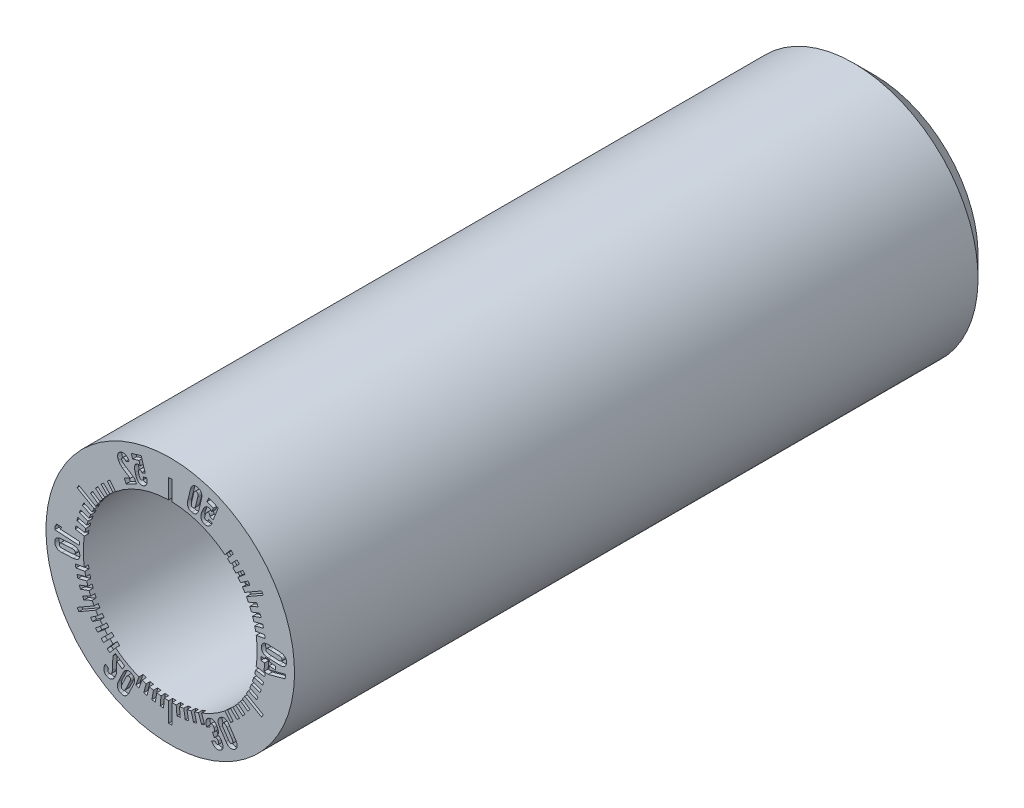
from build123d import *

# Parameters (mm, degrees)
SKETCH2_W          = 0.08
SKETCH2_H          = 0.48
CUT_EXTRUDE1_DEPTH = 0.1


with BuildPart() as part:
    # Sketch1 → Revolve1 (revolve)
    with BuildSketch(Plane(origin=(0, 0, 0), x_dir=(0, 0, -1), z_dir=(1, 0, 0))):
        Polygon((17, 1.5), (17, 2.5), (16.5, 3), (0, 3), (0, 2.1), (3, 2.1), (3, 0.8), (12, 0.8), (12, 1.5), align=None)
    revolve(axis=Axis((0, 0, 0), (0, 0, 1)))

    # Sketch2 → Cut-Extrude1 (cut)
    # profile 1 of 58: a face of its own
    with BuildSketch(Plane.XY):
        Polygon((2.205685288, 1.319641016), (2.245685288, 1.250358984), (1.829993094, 1.010358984), (1.789993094, 1.079641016), align=None)
    # profile 2 of 58: a face of its own
    with BuildSketch(Plane.XY):
        with Locations((0, 2.33)):
            Rectangle(SKETCH2_W, SKETCH2_H)
    # profile 3 of 58: a face of its own
    with BuildSketch(Plane.XY):
        Polygon((-0.22200329, -2.078560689), (-0.142307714, -2.085533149), (-0.162353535, -2.314657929), (-0.242049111, -2.30768547), align=None)
    # profile 4 of 58: a face of its own
    with BuildSketch(Plane.XY):
        Polygon((2.245685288, -1.250358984), (2.205685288, -1.319641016), (1.789993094, -1.079641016), (1.829993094, -1.010358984), align=None)
    # profile 5 of 58: a face of its own
    with BuildSketch(Plane.XY):
        with Locations((0, -2.33)):
            Rectangle(SKETCH2_W, SKETCH2_H)
    # profile 6 of 58: a face of its own
    with BuildSketch(Plane.XY):
        Polygon((-0.402317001, -2.051302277), (-0.323532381, -2.065194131), (-0.363471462, -2.291699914), (-0.442256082, -2.27780806), align=None)
    # profile 7 of 58: a face of its own
    with BuildSketch(Plane.XY):
        Polygon((-2.205685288, -1.319641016), (-2.245685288, -1.250358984), (-1.829993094, -1.010358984), (-1.789993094, -1.079641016), align=None)
    # profile 8 of 58: a face of its own
    with BuildSketch(Plane.XY):
        Polygon((-0.579568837, -2.008432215), (-0.502294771, -2.029137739), (-0.561823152, -2.251300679), (-0.639097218, -2.230595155), align=None)
    # profile 9 of 58: a face of its own
    with BuildSketch(Plane.XY):
        Polygon((-2.245685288, 1.250358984), (-2.205685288, 1.319641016), (-1.789993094, 1.079641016), (-1.829993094, 1.010358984), align=None)
    # profile 10 of 58: a face of its own
    with BuildSketch(Plane.XY):
        Polygon((-0.752409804, -1.950276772), (-0.677234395, -1.977638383), (-0.755899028, -2.193767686), (-0.831074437, -2.166406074), align=None)
    # profile 11 of 58: a face of its own
    with BuildSketch(Plane.XY):
        with BuildLine():
            Line((1.012567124, 2.139475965), (0.931509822, 2.17278633))
            add(Edge.make_bspline(
                [(0.931509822, 2.17278633), (0.927149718, 2.163558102), (0.919493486, 2.15175248), (0.90750455, 2.138416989), (0.898176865, 2.131412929), (0.888604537, 2.126540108), (0.875337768, 2.123610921), (0.865232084, 2.125155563), (0.859103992, 2.127751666)],
                knots=[0, 0, 0, 0, 0.312990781, 0.447470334, 0.570627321, 0.683640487, 0.788056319, 1, 1, 1, 1], degree=3))
            add(Edge.make_bspline(
                [(0.859103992, 2.127751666), (0.852602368, 2.130364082), (0.843675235, 2.136467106), (0.836164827, 2.148482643), (0.83289104, 2.159032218), (0.831745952, 2.170979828), (0.833511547, 2.18971781), (0.83798066, 2.203916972), (0.841915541, 2.21352782)],
                knots=[0, 0, 0, 0, 0.214623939, 0.317977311, 0.427535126, 0.549200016, 0.682311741, 1, 1, 1, 1], degree=3))
            Line((0.841915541, 2.21352782), (0.86048477, 2.2593165))
            add(Edge.make_bspline(
                [(0.86048477, 2.2593165), (0.864442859, 2.268847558), (0.870699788, 2.282292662), (0.882118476, 2.29696064), (0.890653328, 2.304951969), (0.899717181, 2.310325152), (0.912178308, 2.314408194), (0.922056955, 2.312834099), (0.92786212, 2.310392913)],
                knots=[0, 0, 0, 0, 0.329173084, 0.466161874, 0.588661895, 0.698350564, 0.798670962, 1, 1, 1, 1], degree=3))
            add(Edge.make_bspline(
                [(0.92786212, 2.310392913), (0.933485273, 2.308293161), (0.941027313, 2.303439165), (0.949014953, 2.294677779), (0.95341906, 2.286940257), (0.956523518, 2.278329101), (0.959018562, 2.26542631), (0.9581625, 2.255261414), (0.957253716, 2.24845063)],
                knots=[0, 0, 0, 0, 0.24024523, 0.355022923, 0.473972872, 0.595859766, 0.722023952, 1, 1, 1, 1], degree=3))
            Line((0.957253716, 2.24845063), (1.03316966, 2.217608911))
            Line((1.03316966, 2.217608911), (1.160623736, 2.531541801))
            Line((1.160623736, 2.531541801), (0.929024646, 2.625620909))
            Line((0.929024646, 2.625620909), (0.888775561, 2.526511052))
            Line((0.888775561, 2.526511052), (1.039152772, 2.465399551))
            Line((1.039152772, 2.465399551), (0.999966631, 2.368942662))
            add(Edge.make_bspline(
                [(0.999966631, 2.368942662), (0.998267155, 2.373980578), (0.994855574, 2.381498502), (0.988170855, 2.390454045), (0.982213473, 2.397029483), (0.975631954, 2.403157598), (0.966118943, 2.410031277), (0.958539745, 2.414302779), (0.953205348, 2.416406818)],
                knots=[0, 0, 0, 0, 0.232906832, 0.35742045, 0.487452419, 0.620741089, 0.749919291, 1, 1, 1, 1], degree=3))
            add(Edge.make_bspline(
                [(0.953205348, 2.416406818), (0.942679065, 2.420509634), (0.926144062, 2.42489065), (0.903797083, 2.424009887), (0.887622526, 2.42042038), (0.871837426, 2.414070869), (0.856603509, 2.404661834), (0.841923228, 2.392480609), (0.827751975, 2.377617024), (0.814392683, 2.359974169), (0.796692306, 2.332095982), (0.785937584, 2.308707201), (0.779176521, 2.292367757)],
                knots=[0, 0, 0, 0, 0.14203951, 0.210199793, 0.278275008, 0.348605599, 0.422260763, 0.501581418, 0.586912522, 0.678871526, 0.778295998, 1, 1, 1, 1], degree=3))
            Line((0.779176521, 2.292367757), (0.760607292, 2.246579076))
            add(Edge.make_bspline(
                [(0.760607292, 2.246579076), (0.754153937, 2.230108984), (0.745640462, 2.20566197), (0.740046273, 2.172860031), (0.738495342, 2.150339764), (0.73965291, 2.129194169), (0.743246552, 2.109445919), (0.749800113, 2.091337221), (0.758605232, 2.074682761), (0.770295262, 2.059901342), (0.789592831, 2.042189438), (0.807240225, 2.032442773), (0.819810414, 2.027381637)],
                knots=[0, 0, 0, 0, 0.207219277, 0.30093946, 0.388368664, 0.47061663, 0.547977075, 0.622169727, 0.694941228, 0.767314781, 0.841383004, 1, 1, 1, 1], degree=3))
            add(Edge.make_bspline(
                [(0.819810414, 2.027381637), (0.83092788, 2.022851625), (0.84853877, 2.018346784), (0.87252145, 2.018368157), (0.890398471, 2.020947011), (0.908099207, 2.026342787), (0.925285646, 2.03482944), (0.942016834, 2.045895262), (0.958135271, 2.059673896), (0.973416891, 2.076071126), (0.993085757, 2.101978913), (1.005355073, 2.12391518), (1.012567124, 2.139475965)],
                knots=[0, 0, 0, 0, 0.145628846, 0.217084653, 0.28946727, 0.363822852, 0.440348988, 0.520959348, 0.606364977, 0.696725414, 0.792102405, 1, 1, 1, 1], degree=3))
        make_face()
    # profile 12 of 58: a face of its own
    with BuildSketch(Plane.XY):
        with BuildLine():
            Line((0.691740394, 2.254600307), (0.755107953, 2.51545086))
            add(Edge.make_bspline(
                [(0.755107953, 2.51545086), (0.75820861, 2.527610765), (0.761445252, 2.545701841), (0.763339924, 2.569450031), (0.763607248, 2.585968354), (0.762097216, 2.601661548), (0.75963341, 2.616587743), (0.755576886, 2.630677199), (0.750238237, 2.643908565), (0.743577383, 2.656197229), (0.735606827, 2.66746444), (0.726264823, 2.677565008), (0.715694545, 2.68663215), (0.703712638, 2.694331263), (0.685783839, 2.703706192), (0.67087089, 2.708278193), (0.660648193, 2.71094947)],
                knots=[0, 0, 0, 0, 0.15255475, 0.222884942, 0.289580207, 0.353124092, 0.414337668, 0.473292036, 0.531016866, 0.587519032, 0.642883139, 0.698386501, 0.754422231, 0.811742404, 0.871200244, 1, 1, 1, 1], degree=3))
            add(Edge.make_bspline(
                [(0.660648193, 2.71094947), (0.650317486, 2.713475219), (0.634859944, 2.715896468), (0.614526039, 2.716149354), (0.600314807, 2.714575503), (0.586769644, 2.711608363), (0.573892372, 2.706842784), (0.561702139, 2.700542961), (0.550175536, 2.692734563), (0.539395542, 2.683454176), (0.529449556, 2.672746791), (0.520202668, 2.66076646), (0.512012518, 2.647272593), (0.504329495, 2.632597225), (0.495307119, 2.610421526), (0.489746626, 2.592872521), (0.486914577, 2.580587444)],
                knots=[0, 0, 0, 0, 0.129149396, 0.189243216, 0.246495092, 0.302472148, 0.357261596, 0.412781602, 0.46877136, 0.52599839, 0.585182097, 0.646014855, 0.709492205, 0.776677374, 0.847026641, 1, 1, 1, 1], degree=3))
            Line((0.486914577, 2.580587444), (0.423547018, 2.319736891))
            add(Edge.make_bspline(
                [(0.423547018, 2.319736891), (0.420446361, 2.307576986), (0.417209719, 2.28948591), (0.415315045, 2.265737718), (0.415047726, 2.249219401), (0.416557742, 2.233526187), (0.419021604, 2.218600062), (0.423077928, 2.204510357), (0.4284173, 2.191279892), (0.435075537, 2.17898797), (0.443055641, 2.16773264), (0.452329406, 2.157623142), (0.463025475, 2.148720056), (0.474875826, 2.14083757), (0.492891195, 2.13151044), (0.507773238, 2.12689395), (0.518006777, 2.124238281)],
                knots=[0, 0, 0, 0, 0.152562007, 0.222895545, 0.289593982, 0.35314089, 0.414357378, 0.47331455, 0.531042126, 0.587546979, 0.642913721, 0.698419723, 0.753874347, 0.811733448, 0.871194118, 1, 1, 1, 1], degree=3))
            add(Edge.make_bspline(
                [(0.518006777, 2.124238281), (0.52833715, 2.121743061), (0.543760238, 2.119240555), (0.564112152, 2.119113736), (0.578318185, 2.120677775), (0.591903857, 2.123806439), (0.604859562, 2.128478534), (0.617013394, 2.135076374), (0.628635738, 2.142942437), (0.639431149, 2.152367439), (0.64931345, 2.163217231), (0.658543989, 2.175190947), (0.666882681, 2.188550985), (0.674482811, 2.203186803), (0.683430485, 2.225125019), (0.688830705, 2.242511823), (0.691740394, 2.254600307)],
                knots=[0, 0, 0, 0, 0.129287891, 0.189012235, 0.247001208, 0.30266616, 0.35820295, 0.413902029, 0.470380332, 0.528573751, 0.587690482, 0.648588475, 0.712173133, 0.778942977, 0.848882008, 1, 1, 1, 1], degree=3))
        make_face()
        with BuildLine():
            Line((0.514851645, 2.32691207), (0.564759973, 2.532452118))
            add(Edge.make_bspline(
                [(0.564759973, 2.532452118), (0.568055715, 2.54467106), (0.572857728, 2.562186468), (0.583557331, 2.582107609), (0.59163611, 2.593524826), (0.600985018, 2.601982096), (0.615382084, 2.609094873), (0.627722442, 2.608746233), (0.635325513, 2.606813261)],
                knots=[0, 0, 0, 0, 0.331526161, 0.46844105, 0.588018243, 0.694560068, 0.793837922, 1, 1, 1, 1], degree=3))
            add(Edge.make_bspline(
                [(0.635325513, 2.606813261), (0.643027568, 2.605098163), (0.654117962, 2.599658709), (0.663746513, 2.58676388), (0.668214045, 2.574939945), (0.670359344, 2.561079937), (0.670292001, 2.538436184), (0.66687395, 2.52067471), (0.663965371, 2.508327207)],
                knots=[0, 0, 0, 0, 0.206443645, 0.305849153, 0.412344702, 0.53233251, 0.669077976, 1, 1, 1, 1], degree=3))
            Line((0.663965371, 2.508327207), (0.614057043, 2.30278716))
            add(Edge.make_bspline(
                [(0.614057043, 2.30278716), (0.611121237, 2.290420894), (0.60576221, 2.273164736), (0.595419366, 2.252984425), (0.587114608, 2.241685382), (0.577820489, 2.233081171), (0.563218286, 2.226381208), (0.551012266, 2.226253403), (0.543329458, 2.228374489)],
                knots=[0, 0, 0, 0, 0.331056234, 0.467727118, 0.588299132, 0.694660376, 0.793572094, 1, 1, 1, 1], degree=3))
            add(Edge.make_bspline(
                [(0.543329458, 2.228374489), (0.535644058, 2.230105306), (0.524540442, 2.235483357), (0.515011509, 2.248378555), (0.510644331, 2.260202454), (0.508581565, 2.274075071), (0.508657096, 2.29675511), (0.5118223, 2.314566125), (0.514851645, 2.32691207)],
                knots=[0, 0, 0, 0, 0.206549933, 0.305065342, 0.410830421, 0.531716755, 0.668532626, 1, 1, 1, 1], degree=3))
        make_face(mode=Mode.SUBTRACT)
    # profile 13 of 58: a face of its own
    with BuildSketch(Plane.XY):
        Polygon((-1.374067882, -1.575321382), (-1.312784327, -1.626744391), (-1.460625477, -1.802934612), (-1.521909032, -1.751511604), align=None)
    # profile 14 of 58: a face of its own
    with BuildSketch(Plane.XY):
        Polygon((-1.506137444, -1.449568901), (-1.449568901, -1.506137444), (-1.612203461, -1.668772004), (-1.668772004, -1.612203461), align=None)
    # profile 15 of 58: a face of its own
    with BuildSketch(Plane.XY):
        Polygon((-1.626744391, -1.312784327), (-1.575321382, -1.374067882), (-1.751511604, -1.521909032), (-1.802934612, -1.460625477), align=None)
    # profile 16 of 58: a face of its own
    with BuildSketch(Plane.XY):
        Polygon((-1.73497083, -1.16600867), (-1.689084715, -1.231540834), (-1.877489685, -1.363463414), (-1.9233758, -1.297931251), align=None)
    # profile 17 of 58: a face of its own
    with BuildSketch(Plane.XY):
        Polygon((-1.911088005, -0.847019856), (-1.877278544, -0.919524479), (-2.085729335, -1.016726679), (-2.119538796, -0.944222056), align=None)
    # profile 18 of 58: a face of its own
    with BuildSketch(Plane.XY):
        Polygon((-1.977638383, -0.677234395), (-1.950276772, -0.752409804), (-2.166406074, -0.831074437), (-2.193767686, -0.755899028), align=None)
    # profile 19 of 58: a face of its own
    with BuildSketch(Plane.XY):
        Polygon((-2.029137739, -0.502294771), (-2.008432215, -0.579568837), (-2.230595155, -0.639097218), (-2.251300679, -0.561823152), align=None)
    # profile 20 of 58: a face of its own
    with BuildSketch(Plane.XY):
        Polygon((-2.065194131, -0.323532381), (-2.051302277, -0.402317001), (-2.27780806, -0.442256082), (-2.291699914, -0.363471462), align=None)
    # profile 21 of 58: a face of its own
    with BuildSketch(Plane.XY):
        with BuildLine():
            Line((-0.569282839, 2.297528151), (-0.65286232, 2.272143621))
            add(Edge.make_bspline(
                [(-0.65286232, 2.272143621), (-0.650661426, 2.262225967), (-0.648527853, 2.248263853), (-0.649647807, 2.23040026), (-0.652307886, 2.219120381), (-0.656670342, 2.209351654), (-0.664925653, 2.198633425), (-0.673740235, 2.193435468), (-0.680106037, 2.191620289)],
                knots=[0, 0, 0, 0, 0.313997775, 0.448349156, 0.571080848, 0.683382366, 0.788550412, 1, 1, 1, 1], degree=3))
            add(Edge.make_bspline(
                [(-0.680106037, 2.191620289), (-0.686764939, 2.189496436), (-0.697550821, 2.188469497), (-0.710900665, 2.19317526), (-0.720118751, 2.199194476), (-0.72848707, 2.207807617), (-0.739140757, 2.223250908), (-0.744368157, 2.237219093), (-0.747550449, 2.24703004)],
                knots=[0, 0, 0, 0, 0.215045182, 0.317610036, 0.42812181, 0.549157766, 0.682889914, 1, 1, 1, 1], degree=3))
            Line((-0.747550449, 2.24703004), (-0.76210757, 2.29431748))
            add(Edge.make_bspline(
                [(-0.76210757, 2.29431748), (-0.76509783, 2.304175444), (-0.768632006, 2.318525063), (-0.76914942, 2.337057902), (-0.767531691, 2.348604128), (-0.764016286, 2.35845331), (-0.756961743, 2.369429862), (-0.748366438, 2.374393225), (-0.742384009, 2.376254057)],
                knots=[0, 0, 0, 0, 0.329547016, 0.467152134, 0.589297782, 0.699293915, 0.798546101, 1, 1, 1, 1], degree=3))
            add(Edge.make_bspline(
                [(-0.742384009, 2.376254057), (-0.736752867, 2.378045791), (-0.727872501, 2.379322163), (-0.716299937, 2.377292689), (-0.707969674, 2.374390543), (-0.700149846, 2.369708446), (-0.690099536, 2.361238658), (-0.684105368, 2.352968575), (-0.680579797, 2.346991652)],
                knots=[0, 0, 0, 0, 0.239083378, 0.353493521, 0.471595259, 0.593169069, 0.719161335, 1, 1, 1, 1], degree=3))
            Line((-0.680579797, 2.346991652), (-0.602688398, 2.371109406))
            Line((-0.602688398, 2.371109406), (-0.702601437, 2.694740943))
            Line((-0.702601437, 2.694740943), (-0.940365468, 2.621339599))
            Line((-0.940365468, 2.621339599), (-0.908794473, 2.519122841))
            Line((-0.908794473, 2.519122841), (-0.754505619, 2.566774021))
            Line((-0.754505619, 2.566774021), (-0.723800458, 2.467315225))
            add(Edge.make_bspline(
                [(-0.723800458, 2.467315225), (-0.728149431, 2.470492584), (-0.735712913, 2.473616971), (-0.746391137, 2.476834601), (-0.755160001, 2.477904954), (-0.764107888, 2.478315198), (-0.77576005, 2.477831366), (-0.784271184, 2.476099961), (-0.789682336, 2.474419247)],
                knots=[0, 0, 0, 0, 0.234107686, 0.357852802, 0.488706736, 0.620739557, 0.751178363, 1, 1, 1, 1], degree=3))
            add(Edge.make_bspline(
                [(-0.789682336, 2.474419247), (-0.800409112, 2.470998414), (-0.815902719, 2.463956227), (-0.83263703, 2.449280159), (-0.842891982, 2.436306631), (-0.850917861, 2.421357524), (-0.856906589, 2.40451612), (-0.860305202, 2.385772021), (-0.86178438, 2.365283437), (-0.860976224, 2.343169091), (-0.857003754, 2.310375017), (-0.850458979, 2.285496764), (-0.845415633, 2.268535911)],
                knots=[0, 0, 0, 0, 0.141697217, 0.209535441, 0.277427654, 0.348020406, 0.421419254, 0.50068579, 0.586179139, 0.67863213, 0.777784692, 1, 1, 1, 1], degree=3))
            Line((-0.845415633, 2.268535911), (-0.830858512, 2.22124847))
            add(Edge.make_bspline(
                [(-0.830858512, 2.22124847), (-0.825783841, 2.20424575), (-0.816318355, 2.180261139), (-0.800361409, 2.151128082), (-0.787265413, 2.132865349), (-0.773201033, 2.117142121), (-0.757845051, 2.10434032), (-0.741459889, 2.094320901), (-0.724092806, 2.087041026), (-0.705734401, 2.082977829), (-0.679650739, 2.081262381), (-0.659869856, 2.085050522), (-0.646963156, 2.089021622)],
                knots=[0, 0, 0, 0, 0.207804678, 0.301190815, 0.388577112, 0.470615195, 0.547780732, 0.621990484, 0.694946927, 0.767401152, 0.841348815, 1, 1, 1, 1], degree=3))
            add(Edge.make_bspline(
                [(-0.646963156, 2.089021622), (-0.635496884, 2.092484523), (-0.619308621, 2.100324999), (-0.600623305, 2.115170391), (-0.588658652, 2.128584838), (-0.578409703, 2.143900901), (-0.570434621, 2.161260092), (-0.564541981, 2.180390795), (-0.56088456, 2.201245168), (-0.559400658, 2.223587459), (-0.560694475, 2.256111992), (-0.565042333, 2.280882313), (-0.569282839, 2.297528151)],
                knots=[0, 0, 0, 0, 0.145227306, 0.216025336, 0.288647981, 0.362692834, 0.439093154, 0.519843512, 0.605223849, 0.695708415, 0.791338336, 1, 1, 1, 1], degree=3))
        make_face()
    # profile 22 of 58: a face of its own
    with BuildSketch(Plane.XY):
        with BuildLine():
            Line((-0.856824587, 2.132263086), (-1.115203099, 2.305923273))
            add(Edge.make_bspline(
                [(-1.115203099, 2.305923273), (-1.126428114, 2.313425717), (-1.146013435, 2.330008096), (-1.161174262, 2.35076476), (-1.166380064, 2.361613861)],
                knots=[0, 0, 0, 0, 0.529594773, 1, 1, 1, 1], degree=3))
            add(Edge.make_bspline(
                [(-1.166380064, 2.361613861), (-1.169642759, 2.368845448), (-1.173216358, 2.378712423), (-1.173644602, 2.392110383), (-1.171805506, 2.401022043), (-1.16816535, 2.409243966), (-1.160193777, 2.419225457), (-1.151924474, 2.424749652), (-1.14576871, 2.427502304)],
                knots=[0, 0, 0, 0, 0.27628058, 0.396763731, 0.512177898, 0.624234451, 0.740143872, 1, 1, 1, 1], degree=3))
            add(Edge.make_bspline(
                [(-1.14576871, 2.427502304), (-1.139708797, 2.430655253), (-1.129487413, 2.432584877), (-1.115812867, 2.430587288), (-1.10578248, 2.426248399), (-1.095988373, 2.419694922), (-1.0828143, 2.407009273), (-1.074521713, 2.395218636), (-1.069614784, 2.386445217)],
                knots=[0, 0, 0, 0, 0.211891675, 0.317260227, 0.428941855, 0.551462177, 0.684934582, 1, 1, 1, 1], degree=3))
            Line((-1.069614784, 2.386445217), (-0.988137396, 2.424487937))
            add(Edge.make_bspline(
                [(-0.988137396, 2.424487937), (-0.996502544, 2.440089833), (-1.00995192, 2.461512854), (-1.03100048, 2.486562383), (-1.047172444, 2.502118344), (-1.064045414, 2.515051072), (-1.081509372, 2.525046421), (-1.099347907, 2.532429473), (-1.117634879, 2.536858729), (-1.136173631, 2.538338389), (-1.161272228, 2.536336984), (-1.179504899, 2.530503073), (-1.19109566, 2.525101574)],
                knots=[0, 0, 0, 0, 0.206179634, 0.29971853, 0.388669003, 0.472666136, 0.552006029, 0.627422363, 0.701644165, 0.774934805, 0.8477835, 1, 1, 1, 1], degree=3))
            add(Edge.make_bspline(
                [(-1.19109566, 2.525101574), (-1.203290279, 2.519207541), (-1.220657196, 2.509218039), (-1.239561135, 2.491486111), (-1.250962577, 2.477321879), (-1.259975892, 2.46189584), (-1.266204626, 2.445229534), (-1.270098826, 2.427551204), (-1.271025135, 2.408869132), (-1.26978444, 2.389311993), (-1.264133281, 2.361229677), (-1.256413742, 2.340421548), (-1.249784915, 2.326715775)],
                knots=[0, 0, 0, 0, 0.173465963, 0.252943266, 0.329718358, 0.404937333, 0.480032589, 0.55602585, 0.635156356, 0.718067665, 0.805679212, 1, 1, 1, 1], degree=3))
            add(Edge.make_bspline(
                [(-1.249784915, 2.326715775), (-1.24378032, 2.314277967), (-1.233985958, 2.296588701), (-1.218497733, 2.274437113), (-1.205620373, 2.258688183), (-1.192079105, 2.243706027), (-1.173136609, 2.225633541), (-1.157708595, 2.213792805), (-1.146949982, 2.206839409)],
                knots=[0, 0, 0, 0, 0.252707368, 0.379472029, 0.507964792, 0.635168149, 0.759146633, 1, 1, 1, 1], degree=3))
            Line((-1.146949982, 2.206839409), (-0.964890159, 2.089168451))
            Line((-0.964890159, 2.089168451), (-1.108742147, 2.021339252))
            Line((-1.108742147, 2.021339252), (-1.062847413, 1.924051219))
            Line((-1.062847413, 1.924051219), (-0.813938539, 2.041346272))
            Line((-0.813938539, 2.041346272), (-0.856824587, 2.132263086))
        make_face()
    # profile 23 of 58: a face of its own
    with BuildSketch(Plane.XY):
        Polygon((-2.051302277, 0.402317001), (-2.065194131, 0.323532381), (-2.291699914, 0.363471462), (-2.27780806, 0.442256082), align=None)
    # profile 24 of 58: a face of its own
    with BuildSketch(Plane.XY):
        Polygon((-2.008432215, 0.579568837), (-2.029137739, 0.502294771), (-2.251300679, 0.561823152), (-2.230595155, 0.639097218), align=None)
    # profile 25 of 58: a face of its own
    with BuildSketch(Plane.XY):
        Polygon((-1.950276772, 0.752409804), (-1.977638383, 0.677234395), (-2.193767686, 0.755899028), (-2.166406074, 0.831074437), align=None)
    # profile 26 of 58: a face of its own
    with BuildSketch(Plane.XY):
        Polygon((-1.877278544, 0.919524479), (-1.911088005, 0.847019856), (-2.119538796, 0.944222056), (-2.085729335, 1.016726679), align=None)
    # profile 27 of 58: a face of its own
    with BuildSketch(Plane.XY):
        Polygon((-1.689084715, 1.231540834), (-1.73497083, 1.16600867), (-1.9233758, 1.297931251), (-1.877489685, 1.363463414), align=None)
    # profile 28 of 58: a face of its own
    with BuildSketch(Plane.XY):
        Polygon((-1.575321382, 1.374067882), (-1.626744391, 1.312784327), (-1.802934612, 1.460625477), (-1.751511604, 1.521909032), align=None)
    # profile 29 of 58: a face of its own
    with BuildSketch(Plane.XY):
        Polygon((-1.449568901, 1.506137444), (-1.506137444, 1.449568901), (-1.668772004, 1.612203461), (-1.612203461, 1.668772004), align=None)
    # profile 30 of 58: a face of its own
    with BuildSketch(Plane.XY):
        Polygon((-1.312784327, 1.626744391), (-1.374067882, 1.575321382), (-1.521909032, 1.751511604), (-1.460625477, 1.802934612), align=None)
    # profile 31 of 58: a face of its own
    with BuildSketch(Plane.XY):
        Polygon((-2.197118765, 0.068190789), (-2.192026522, 0.155720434), (-2.651430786, 0.182500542), (-2.620837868, 0.237409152), (-2.739030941, 0.244250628), (-2.782763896, 0.177312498), (-2.787100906, 0.102525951), align=None)
    # profile 32 of 58: a face of its own
    with BuildSketch(Plane.XY):
        with BuildLine():
            Line((-2.358344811, 0.005855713), (-2.626580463, -0.009382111))
            add(Edge.make_bspline(
                [(-2.626580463, -0.009382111), (-2.639136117, -0.010203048), (-2.657440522, -0.012083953), (-2.680768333, -0.017192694), (-2.696615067, -0.022002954), (-2.711336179, -0.027830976), (-2.724798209, -0.034889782), (-2.737186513, -0.042772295), (-2.748274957, -0.051810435), (-2.758181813, -0.061752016), (-2.766449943, -0.072857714), (-2.773639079, -0.08469988), (-2.778999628, -0.09764446), (-2.783080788, -0.111400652), (-2.786533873, -0.131523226), (-2.787048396, -0.147217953), (-2.786313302, -0.157905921)],
                knots=[0, 0, 0, 0, 0.152361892, 0.222101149, 0.288692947, 0.35258765, 0.41338833, 0.472388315, 0.529973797, 0.586180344, 0.641757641, 0.69714838, 0.753398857, 0.810781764, 0.870479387, 1, 1, 1, 1], degree=3))
            add(Edge.make_bspline(
                [(-2.786313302, -0.157905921), (-2.785781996, -0.168621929), (-2.783506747, -0.184188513), (-2.777958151, -0.203914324), (-2.772263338, -0.217116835), (-2.765449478, -0.229360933), (-2.757153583, -0.240392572), (-2.747551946, -0.250333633), (-2.736750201, -0.259181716), (-2.724644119, -0.26675095), (-2.711530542, -0.27331625), (-2.697293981, -0.278524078), (-2.682092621, -0.282864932), (-2.665757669, -0.285577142), (-2.641943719, -0.288129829), (-2.623462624, -0.287819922), (-2.610858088, -0.287243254)],
                knots=[0, 0, 0, 0, 0.129655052, 0.189679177, 0.247360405, 0.303196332, 0.358829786, 0.413817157, 0.470049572, 0.527297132, 0.586204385, 0.647138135, 0.710435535, 0.777173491, 0.847173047, 1, 1, 1, 1], degree=3))
            Line((-2.610858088, -0.287243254), (-2.342622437, -0.272005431))
            add(Edge.make_bspline(
                [(-2.342622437, -0.272005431), (-2.330105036, -0.27119814), (-2.311805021, -0.269292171), (-2.288473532, -0.264206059), (-2.272619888, -0.259407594), (-2.257955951, -0.253542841), (-2.24452185, -0.246514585), (-2.232141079, -0.238624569), (-2.221029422, -0.229603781), (-2.211206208, -0.219602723), (-2.202629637, -0.20871196), (-2.195779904, -0.196692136), (-2.190290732, -0.183837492), (-2.186082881, -0.170127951), (-2.182676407, -0.149979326), (-2.182129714, -0.134291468), (-2.182876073, -0.123601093)],
                knots=[0, 0, 0, 0, 0.151970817, 0.222235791, 0.288868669, 0.352335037, 0.413173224, 0.472209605, 0.529830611, 0.58607183, 0.641670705, 0.697193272, 0.753056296, 0.810665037, 0.870399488, 1, 1, 1, 1], degree=3))
            add(Edge.make_bspline(
                [(-2.182876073, -0.123601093), (-2.183473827, -0.112906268), (-2.185561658, -0.097272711), (-2.191401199, -0.077632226), (-2.197011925, -0.064308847), (-2.204098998, -0.05217632), (-2.21244566, -0.041049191), (-2.222216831, -0.0311558), (-2.233211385, -0.022302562), (-2.245313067, -0.014593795), (-2.258580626, -0.008235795), (-2.272694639, -0.002747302), (-2.287962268, 0.001261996), (-2.304136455, 0.00434039), (-2.327731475, 0.006437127), (-2.345922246, 0.006807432), (-2.358344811, 0.005855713)],
                knots=[0, 0, 0, 0, 0.129785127, 0.189953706, 0.247692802, 0.304415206, 0.359686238, 0.415706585, 0.472335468, 0.530322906, 0.589027, 0.650243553, 0.713423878, 0.779903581, 0.849396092, 1, 1, 1, 1], degree=3))
        make_face()
        with BuildLine():
            Line((-2.376060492, -0.186126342), (-2.587433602, -0.198073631))
            add(Edge.make_bspline(
                [(-2.587433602, -0.198073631), (-2.600127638, -0.198585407), (-2.61831385, -0.198973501), (-2.64057439, -0.194604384), (-2.653860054, -0.190060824), (-2.664613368, -0.183493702), (-2.675556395, -0.17168349), (-2.678824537, -0.159749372), (-2.679186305, -0.151829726)],
                knots=[0, 0, 0, 0, 0.331488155, 0.468204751, 0.587932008, 0.694653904, 0.792379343, 1, 1, 1, 1], degree=3))
            add(Edge.make_bspline(
                [(-2.679186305, -0.151829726), (-2.679532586, -0.143974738), (-2.67795175, -0.13157426), (-2.668260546, -0.118669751), (-2.658393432, -0.110750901), (-2.645628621, -0.104874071), (-2.624053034, -0.09788262), (-2.605937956, -0.096149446), (-2.593261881, -0.095274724)],
                knots=[0, 0, 0, 0, 0.207404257, 0.306093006, 0.412310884, 0.532766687, 0.668670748, 1, 1, 1, 1], degree=3))
            Line((-2.593261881, -0.095274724), (-2.381888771, -0.083327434))
            add(Edge.make_bspline(
                [(-2.381888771, -0.083327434), (-2.369163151, -0.082603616), (-2.351041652, -0.082717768), (-2.328730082, -0.086759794), (-2.31546105, -0.091346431), (-2.304669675, -0.0979447), (-2.293650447, -0.109765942), (-2.290319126, -0.121743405), (-2.290003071, -0.129677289)],
                knots=[0, 0, 0, 0, 0.331220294, 0.467434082, 0.586995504, 0.693569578, 0.792612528, 1, 1, 1, 1], degree=3))
            add(Edge.make_bspline(
                [(-2.290003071, -0.129677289), (-2.289554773, -0.137554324), (-2.291385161, -0.149791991), (-2.300852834, -0.16288851), (-2.310969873, -0.170584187), (-2.323677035, -0.176546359), (-2.345283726, -0.183501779), (-2.363375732, -0.18526168), (-2.376060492, -0.186126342)],
                knots=[0, 0, 0, 0, 0.20642854, 0.305872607, 0.412399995, 0.532837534, 0.668720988, 1, 1, 1, 1], degree=3))
        make_face(mode=Mode.SUBTRACT)
    # profile 33 of 58: a face of its own
    with BuildSketch(Plane.XY):
        with BuildLine():
            Line((-1.383614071, -1.834607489), (-1.397987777, -2.145306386))
            add(Edge.make_bspline(
                [(-1.397987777, -2.145306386), (-1.398455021, -2.158795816), (-1.402629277, -2.184026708), (-1.412232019, -2.207787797), (-1.418906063, -2.217778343)],
                knots=[0, 0, 0, 0, 0.530063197, 1, 1, 1, 1], degree=3))
            add(Edge.make_bspline(
                [(-1.418906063, -2.217778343), (-1.423262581, -2.224334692), (-1.430061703, -2.232276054), (-1.441177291, -2.239752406), (-1.449775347, -2.242756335), (-1.458670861, -2.243874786), (-1.47137353, -2.242179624), (-1.480365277, -2.237865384), (-1.48597864, -2.234089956)],
                knots=[0, 0, 0, 0, 0.276237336, 0.397001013, 0.511354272, 0.623690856, 0.739101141, 1, 1, 1, 1], degree=3))
            add(Edge.make_bspline(
                [(-1.48597864, -2.234089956), (-1.491736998, -2.230449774), (-1.498794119, -2.222810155), (-1.504146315, -2.210066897), (-1.505735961, -2.199284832), (-1.50519645, -2.187466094), (-1.501181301, -2.169608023), (-1.495311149, -2.156402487), (-1.490465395, -2.147608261)],
                knots=[0, 0, 0, 0, 0.212205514, 0.316427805, 0.428810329, 0.550715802, 0.68516851, 1, 1, 1, 1], degree=3))
            Line((-1.490465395, -2.147608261), (-1.565265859, -2.097429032))
            add(Edge.make_bspline(
                [(-1.565265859, -2.097429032), (-1.574127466, -2.112763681), (-1.58585259, -2.135255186), (-1.595988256, -2.166378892), (-1.60110256, -2.188233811), (-1.603271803, -2.209318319), (-1.603021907, -2.229426), (-1.599947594, -2.248520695), (-1.594128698, -2.266425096), (-1.585967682, -2.283138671), (-1.570989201, -2.303451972), (-1.556792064, -2.31632893), (-1.545916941, -2.32326565)],
                knots=[0, 0, 0, 0, 0.205825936, 0.299741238, 0.388594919, 0.472186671, 0.551118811, 0.627055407, 0.701176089, 0.774239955, 0.847174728, 1, 1, 1, 1], degree=3))
            add(Edge.make_bspline(
                [(-1.545916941, -2.32326565), (-1.534590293, -2.330813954), (-1.51687667, -2.340125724), (-1.491964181, -2.347399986), (-1.47390242, -2.349850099), (-1.456070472, -2.349472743), (-1.438568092, -2.346458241), (-1.421586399, -2.340384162), (-1.404942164, -2.331909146), (-1.388990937, -2.320486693), (-1.367776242, -2.301353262), (-1.354388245, -2.283658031), (-1.345886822, -2.271178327)],
                knots=[0, 0, 0, 0, 0.174054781, 0.253492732, 0.330628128, 0.406059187, 0.480620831, 0.556571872, 0.635695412, 0.71859072, 0.806559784, 1, 1, 1, 1], degree=3))
            add(Edge.make_bspline(
                [(-1.345886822, -2.271178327), (-1.338322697, -2.2595904), (-1.32815405, -2.242119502), (-1.317325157, -2.217397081), (-1.310421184, -2.198285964), (-1.304709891, -2.178941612), (-1.299209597, -2.153394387), (-1.297174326, -2.134096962), (-1.296712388, -2.121342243)],
                knots=[0, 0, 0, 0, 0.252676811, 0.379806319, 0.508074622, 0.635331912, 0.759559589, 1, 1, 1, 1], degree=3))
            Line((-1.296712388, -2.121342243), (-1.290550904, -1.90477977))
            Line((-1.290550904, -1.90477977), (-1.157862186, -1.993051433))
            Line((-1.157862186, -1.993051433), (-1.098442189, -1.903571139))
            Line((-1.098442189, -1.903571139), (-1.328034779, -1.750903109))
            Line((-1.328034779, -1.750903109), (-1.383614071, -1.834607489))
        make_face()
    # profile 34 of 58: a face of its own
    with BuildSketch(Plane.XY):
        with BuildLine():
            Line((-1.138335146, -2.064320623), (-1.253359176, -2.305237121))
            add(Edge.make_bspline(
                [(-1.253359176, -2.305237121), (-1.258760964, -2.31648175), (-1.265656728, -2.333413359), (-1.272310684, -2.356181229), (-1.275822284, -2.372269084), (-1.277608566, -2.387879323), (-1.278057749, -2.402981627), (-1.276960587, -2.417575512), (-1.274343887, -2.431629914), (-1.270156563, -2.44497605), (-1.26469493, -2.45768946), (-1.25741737, -2.469401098), (-1.248833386, -2.480458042), (-1.238670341, -2.490659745), (-1.222676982, -2.503494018), (-1.209023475, -2.511366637), (-1.199340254, -2.515949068)],
                knots=[0, 0, 0, 0, 0.151392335, 0.221280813, 0.287669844, 0.35095401, 0.411674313, 0.47076574, 0.52821505, 0.584753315, 0.640208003, 0.695649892, 0.751590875, 0.80976241, 0.869956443, 1, 1, 1, 1], degree=3))
            add(Edge.make_bspline(
                [(-1.199340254, -2.515949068), (-1.189687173, -2.520642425), (-1.174939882, -2.526334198), (-1.154892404, -2.530724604), (-1.140602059, -2.532264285), (-1.126624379, -2.532134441), (-1.112975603, -2.530185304), (-1.09961054, -2.526730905), (-1.086660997, -2.521534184), (-1.07424315, -2.514663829), (-1.062262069, -2.506353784), (-1.050746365, -2.49657109), (-1.039858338, -2.485215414), (-1.029495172, -2.472414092), (-1.01590428, -2.452897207), (-1.007232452, -2.436706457), (-1.001786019, -2.425404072)],
                knots=[0, 0, 0, 0, 0.130248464, 0.190774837, 0.248540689, 0.304283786, 0.359907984, 0.415404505, 0.471390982, 0.528715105, 0.587231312, 0.648032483, 0.711724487, 0.777815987, 0.847683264, 1, 1, 1, 1], degree=3))
            Line((-1.001786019, -2.425404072), (-0.886761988, -2.184487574))
            add(Edge.make_bspline(
                [(-0.886761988, -2.184487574), (-0.881470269, -2.173224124), (-0.874341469, -2.156400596), (-0.867741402, -2.133634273), (-0.864223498, -2.117549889), (-0.862430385, -2.101938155), (-0.862013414, -2.086871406), (-0.862990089, -2.072301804), (-0.865632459, -2.058282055), (-0.869812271, -2.044936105), (-0.875273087, -2.032219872), (-0.882561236, -2.020519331), (-0.891080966, -2.009448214), (-0.90137992, -1.999433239), (-0.917285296, -1.986561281), (-0.930978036, -1.978727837), (-0.940647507, -1.974131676)],
                knots=[0, 0, 0, 0, 0.151306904, 0.22127104, 0.28773194, 0.351084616, 0.411870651, 0.470625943, 0.528137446, 0.584736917, 0.640251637, 0.695753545, 0.751755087, 0.809556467, 0.869815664, 1, 1, 1, 1], degree=3))
            add(Edge.make_bspline(
                [(-0.940647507, -1.974131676), (-0.950299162, -1.969429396), (-0.965050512, -1.963763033), (-0.985119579, -1.959327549), (-0.999486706, -1.957888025), (-1.013513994, -1.958127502), (-1.027233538, -1.959991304), (-1.040588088, -1.963722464), (-1.053630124, -1.968930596), (-1.066133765, -1.975894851), (-1.078154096, -1.984218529), (-1.089601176, -1.99400602), (-1.100566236, -2.005170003), (-1.110806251, -2.017953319), (-1.124428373, -2.037164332), (-1.132939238, -2.053199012), (-1.138335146, -2.064320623)],
                knots=[0, 0, 0, 0, 0.130430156, 0.191040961, 0.249232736, 0.305436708, 0.361138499, 0.416959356, 0.473489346, 0.531372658, 0.590456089, 0.650855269, 0.714094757, 0.780278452, 0.849640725, 1, 1, 1, 1], degree=3))
        make_face()
        with BuildLine():
            Line((-0.97814681, -2.172277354), (-1.068796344, -2.3620774))
            add(Edge.make_bspline(
                [(-1.068796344, -2.3620774), (-1.074349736, -2.373418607), (-1.082914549, -2.389278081), (-1.097272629, -2.406685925), (-1.107703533, -2.416003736), (-1.118682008, -2.422229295), (-1.13430603, -2.426114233), (-1.146364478, -2.423259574), (-1.15344995, -2.419740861)],
                knots=[0, 0, 0, 0, 0.330104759, 0.466404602, 0.586663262, 0.692852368, 0.792422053, 1, 1, 1, 1], degree=3))
            add(Edge.make_bspline(
                [(-1.15344995, -2.419740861), (-1.160669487, -2.416395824), (-1.170543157, -2.408818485), (-1.177444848, -2.394196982), (-1.179486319, -2.381709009), (-1.178775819, -2.367737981), (-1.174096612, -2.345687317), (-1.167432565, -2.3290134), (-1.161992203, -2.317616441)],
                knots=[0, 0, 0, 0, 0.208645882, 0.30841126, 0.414472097, 0.535067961, 0.670735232, 1, 1, 1, 1], degree=3))
            Line((-1.161992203, -2.317616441), (-1.071342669, -2.127816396))
            add(Edge.make_bspline(
                [(-1.071342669, -2.127816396), (-1.066050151, -2.116269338), (-1.057103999, -2.100656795), (-1.042851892, -2.08317122), (-1.032432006, -2.073890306), (-1.021458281, -2.067670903), (-1.005803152, -2.063737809), (-0.993731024, -2.066812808), (-0.986613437, -2.070246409)],
                knots=[0, 0, 0, 0, 0.330938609, 0.466108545, 0.586274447, 0.692381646, 0.791874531, 1, 1, 1, 1], degree=3))
            add(Edge.make_bspline(
                [(-0.986613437, -2.070246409), (-0.979400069, -2.073534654), (-0.969579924, -2.081112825), (-0.962695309, -2.095696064), (-0.960655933, -2.108129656), (-0.961378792, -2.122062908), (-0.965856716, -2.144159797), (-0.972683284, -2.160864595), (-0.97814681, -2.172277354)],
                knots=[0, 0, 0, 0, 0.207839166, 0.307691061, 0.413843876, 0.53307009, 0.669524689, 1, 1, 1, 1], degree=3))
        make_face(mode=Mode.SUBTRACT)
    # profile 35 of 58: a face of its own
    with BuildSketch(Plane.XY):
        with BuildLine():
            Line((0.877123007, -2.186901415), (0.958975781, -2.147765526))
            add(Edge.make_bspline(
                [(0.958975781, -2.147765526), (0.957095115, -2.142374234), (0.95487269, -2.134379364), (0.95346558, -2.123716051), (0.953203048, -2.114207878), (0.954677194, -2.103084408), (0.961335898, -2.087242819), (0.971194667, -2.078619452), (0.978795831, -2.075208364)],
                knots=[0, 0, 0, 0, 0.206361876, 0.298526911, 0.387885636, 0.549536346, 0.699892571, 1, 1, 1, 1], degree=3))
            add(Edge.make_bspline(
                [(0.978795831, -2.075208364), (0.985554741, -2.071869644), (0.996515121, -2.068859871), (1.011263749, -2.070222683), (1.021561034, -2.074103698), (1.031203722, -2.080420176), (1.043713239, -2.092651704), (1.050560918, -2.104648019), (1.054815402, -2.113128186)],
                knots=[0, 0, 0, 0, 0.235571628, 0.344866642, 0.457218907, 0.57547521, 0.702325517, 1, 1, 1, 1], degree=3))
            Line((1.054815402, -2.113128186), (1.060746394, -2.12549371))
            add(Edge.make_bspline(
                [(1.060746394, -2.12549371), (1.06492665, -2.134489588), (1.070324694, -2.1476926), (1.073423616, -2.165307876), (1.073589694, -2.176619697), (1.071357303, -2.186590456), (1.06587619, -2.198277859), (1.058029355, -2.204303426), (1.052394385, -2.207006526)],
                knots=[0, 0, 0, 0, 0.325479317, 0.461991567, 0.583187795, 0.692815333, 0.793623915, 1, 1, 1, 1], degree=3))
            Line((1.052394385, -2.207006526), (1.016841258, -2.224036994))
            Line((1.016841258, -2.224036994), (1.062875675, -2.320118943))
            Line((1.062875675, -2.320118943), (1.098428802, -2.303088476))
            add(Edge.make_bspline(
                [(1.098428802, -2.303088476), (1.103074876, -2.300964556), (1.111059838, -2.299160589), (1.121445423, -2.302020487), (1.129090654, -2.306226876), (1.136385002, -2.312625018), (1.146346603, -2.32430668), (1.15222304, -2.335012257), (1.155981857, -2.342628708)],
                knots=[0, 0, 0, 0, 0.199061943, 0.299368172, 0.40943286, 0.533145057, 0.671416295, 1, 1, 1, 1], degree=3))
            Line((1.155981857, -2.342628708), (1.160369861, -2.351738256))
            add(Edge.make_bspline(
                [(1.160369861, -2.351738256), (1.163549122, -2.359067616), (1.16816974, -2.369779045), (1.169883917, -2.384283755), (1.169707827, -2.393675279), (1.167364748, -2.402058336), (1.161899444, -2.411855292), (1.155117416, -2.417129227), (1.150037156, -2.419439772)],
                knots=[0, 0, 0, 0, 0.31392862, 0.446516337, 0.567130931, 0.677704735, 0.782241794, 1, 1, 1, 1], degree=3))
            add(Edge.make_bspline(
                [(1.150037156, -2.419439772), (1.146609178, -2.421225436), (1.140926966, -2.422705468), (1.133109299, -2.422826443), (1.127068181, -2.422009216), (1.120957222, -2.420124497), (1.114809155, -2.417315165), (1.108664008, -2.413556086), (1.102514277, -2.408865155), (1.096394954, -2.403261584), (1.088012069, -2.394403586), (1.082563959, -2.386680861), (1.078957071, -2.381337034)],
                knots=[0, 0, 0, 0, 0.131236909, 0.197306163, 0.266084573, 0.338524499, 0.414880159, 0.496374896, 0.584017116, 0.678618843, 0.779470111, 1, 1, 1, 1], degree=3))
            Line((1.078957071, -2.381337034), (0.997442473, -2.420436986))
            add(Edge.make_bspline(
                [(0.997442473, -2.420436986), (1.005757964, -2.435135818), (1.019651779, -2.455576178), (1.040999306, -2.47951472), (1.05766939, -2.494119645), (1.074739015, -2.50638858), (1.092328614, -2.515823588), (1.110270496, -2.522518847), (1.128448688, -2.526549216), (1.146653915, -2.527790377), (1.170867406, -2.52582739), (1.188322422, -2.520141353), (1.199341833, -2.514917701)],
                knots=[0, 0, 0, 0, 0.205125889, 0.299292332, 0.38899361, 0.473908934, 0.554242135, 0.6307891, 0.705934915, 0.779710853, 0.851709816, 1, 1, 1, 1], degree=3))
            add(Edge.make_bspline(
                [(1.199341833, -2.514917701), (1.208130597, -2.510654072), (1.220655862, -2.503550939), (1.235307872, -2.491830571), (1.244556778, -2.482393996), (1.252738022, -2.472416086), (1.259469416, -2.461590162), (1.264757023, -2.449959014), (1.26876717, -2.437694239), (1.271449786, -2.424830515), (1.272540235, -2.411388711), (1.272356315, -2.397493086), (1.27067778, -2.383133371), (1.267737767, -2.368281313), (1.261575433, -2.347301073), (1.254983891, -2.331770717), (1.250161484, -2.321334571)],
                knots=[0, 0, 0, 0, 0.128965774, 0.189013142, 0.246939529, 0.302986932, 0.358929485, 0.414586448, 0.471150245, 0.528851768, 0.587511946, 0.648712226, 0.711899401, 0.777973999, 0.84823399, 1, 1, 1, 1], degree=3))
            Line((1.250161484, -2.321334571), (1.242558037, -2.305299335))
            add(Edge.make_bspline(
                [(1.242558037, -2.305299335), (1.237016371, -2.29376403), (1.227308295, -2.277511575), (1.210817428, -2.259231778), (1.19753167, -2.247993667), (1.183219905, -2.238996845), (1.162947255, -2.230323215), (1.146628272, -2.227466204), (1.13570821, -2.227478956)],
                knots=[0, 0, 0, 0, 0.275437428, 0.403658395, 0.52777977, 0.648457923, 0.765765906, 1, 1, 1, 1], degree=3))
            add(Edge.make_bspline(
                [(1.13570821, -2.227478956), (1.144383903, -2.220017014), (1.154592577, -2.205679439), (1.161997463, -2.183246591), (1.164234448, -2.164428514), (1.163352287, -2.144158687), (1.157661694, -2.11420927), (1.149196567, -2.091963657), (1.141967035, -2.077191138)],
                knots=[0, 0, 0, 0, 0.211305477, 0.319373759, 0.435625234, 0.561120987, 0.694600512, 1, 1, 1, 1], degree=3))
            Line((1.141967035, -2.077191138), (1.134363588, -2.061155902))
            add(Edge.make_bspline(
                [(1.134363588, -2.061155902), (1.127535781, -2.046792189), (1.115961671, -2.02663314), (1.097266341, -2.003237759), (1.082672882, -1.988850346), (1.06716927, -1.97720787), (1.050886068, -1.968185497), (1.033817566, -1.962029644), (1.016020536, -1.958758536), (0.997689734, -1.958340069), (0.971975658, -1.961535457), (0.95328896, -1.968617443), (0.941047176, -1.974227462)],
                knots=[0, 0, 0, 0, 0.198329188, 0.288290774, 0.372608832, 0.45310549, 0.52925478, 0.603835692, 0.678282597, 0.753831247, 0.831568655, 1, 1, 1, 1], degree=3))
            add(Edge.make_bspline(
                [(0.941047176, -1.974227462), (0.92883518, -1.979946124), (0.911903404, -1.990661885), (0.892852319, -2.008820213), (0.881123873, -2.02397132), (0.871613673, -2.040574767), (0.864378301, -2.058462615), (0.86010741, -2.077750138), (0.858040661, -2.09811112), (0.85868176, -2.119439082), (0.863020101, -2.14978321), (0.871028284, -2.172058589), (0.877123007, -2.186901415)],
                knots=[0, 0, 0, 0, 0.162701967, 0.239769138, 0.316723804, 0.393176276, 0.470165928, 0.548727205, 0.630867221, 0.716683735, 0.805714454, 1, 1, 1, 1], degree=3))
        make_face()
    # profile 36 of 58: a face of its own
    with BuildSketch(Plane.XY):
        with BuildLine():
            Line((1.193321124, -2.034455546), (1.342753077, -2.258150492))
            add(Edge.make_bspline(
                [(1.342753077, -2.258150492), (1.349794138, -2.26858586), (1.360751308, -2.2834554), (1.377151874, -2.300901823), (1.389223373, -2.31226002), (1.401758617, -2.321907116), (1.414647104, -2.329945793), (1.427773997, -2.336671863), (1.441298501, -2.341507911), (1.454892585, -2.345042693), (1.468683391, -2.346581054), (1.482533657, -2.346647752), (1.496451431, -2.344665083), (1.510431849, -2.341186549), (1.529683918, -2.334001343), (1.54350433, -2.326341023), (1.552413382, -2.320304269)],
                knots=[0, 0, 0, 0, 0.15205791, 0.222195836, 0.288775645, 0.351904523, 0.412740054, 0.471914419, 0.529528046, 0.585760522, 0.641042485, 0.696558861, 0.752478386, 0.81023601, 0.870141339, 1, 1, 1, 1], degree=3))
            add(Edge.make_bspline(
                [(1.552413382, -2.320304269), (1.561323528, -2.314270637), (1.573865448, -2.304620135), (1.587826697, -2.289567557), (1.596399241, -2.278010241), (1.603567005, -2.265929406), (1.608990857, -2.253158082), (1.612581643, -2.239770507), (1.614820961, -2.225960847), (1.615336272, -2.211639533), (1.614162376, -2.196999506), (1.611555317, -2.18202643), (1.607409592, -2.166770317), (1.60164549, -2.151176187), (1.591470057, -2.129426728), (1.58218592, -2.113397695), (1.575087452, -2.102920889)],
                knots=[0, 0, 0, 0, 0.129992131, 0.189815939, 0.247167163, 0.303313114, 0.358925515, 0.413986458, 0.470167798, 0.5273884, 0.586427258, 0.647066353, 0.710515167, 0.776906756, 0.847398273, 1, 1, 1, 1], degree=3))
            Line((1.575087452, -2.102920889), (1.425655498, -1.879225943))
            add(Edge.make_bspline(
                [(1.425655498, -1.879225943), (1.418643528, -1.868762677), (1.407625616, -1.854001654), (1.391388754, -1.83646837), (1.379197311, -1.825245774), (1.366600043, -1.815652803), (1.353850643, -1.807366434), (1.34061951, -1.800946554), (1.327245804, -1.795811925), (1.313532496, -1.792557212), (1.299759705, -1.790862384), (1.285868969, -1.790932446), (1.27200254, -1.792792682), (1.257996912, -1.796232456), (1.238896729, -1.80357882), (1.225065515, -1.811120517), (1.216217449, -1.81716398)],
                knots=[0, 0, 0, 0, 0.15222706, 0.222002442, 0.288488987, 0.352155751, 0.413141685, 0.471865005, 0.529524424, 0.585892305, 0.641702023, 0.69683321, 0.753234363, 0.810379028, 0.870680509, 1, 1, 1, 1], degree=3))
            add(Edge.make_bspline(
                [(1.216217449, -1.81716398), (1.207322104, -1.82321108), (1.194708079, -1.832846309), (1.180764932, -1.848019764), (1.172143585, -1.859629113), (1.165068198, -1.871813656), (1.159812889, -1.884677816), (1.156046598, -1.89808583), (1.154176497, -1.912069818), (1.15366799, -1.926447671), (1.154831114, -1.941145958), (1.157476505, -1.956082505), (1.161448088, -1.971361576), (1.16725101, -1.986825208), (1.177106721, -2.00840321), (1.186453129, -2.024082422), (1.193321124, -2.034455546)],
                knots=[0, 0, 0, 0, 0.130196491, 0.190568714, 0.248479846, 0.304649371, 0.360347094, 0.415975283, 0.472477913, 0.53041132, 0.589542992, 0.650277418, 0.713531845, 0.780027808, 0.84959087, 1, 1, 1, 1], degree=3))
        make_face()
        with BuildLine():
            Line((1.368347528, -1.951819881), (1.486179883, -2.128246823))
            add(Edge.make_bspline(
                [(1.486179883, -2.128246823), (1.493329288, -2.13880142), (1.502429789, -2.154466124), (1.510167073, -2.175780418), (1.512967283, -2.189550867), (1.51268126, -2.202228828), (1.508151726, -2.21777027), (1.499261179, -2.226545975), (1.492772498, -2.231010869)],
                knots=[0, 0, 0, 0, 0.331175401, 0.466656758, 0.586919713, 0.69352505, 0.79274525, 1, 1, 1, 1], degree=3))
            add(Edge.make_bspline(
                [(1.492772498, -2.231010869), (1.486178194, -2.235483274), (1.474602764, -2.240210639), (1.458435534, -2.238547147), (1.44662581, -2.233855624), (1.434880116, -2.226074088), (1.418232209, -2.210644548), (1.407244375, -2.196276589), (1.400126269, -2.185713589)],
                knots=[0, 0, 0, 0, 0.208263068, 0.307067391, 0.414000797, 0.534294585, 0.669858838, 1, 1, 1, 1], degree=3))
            Line((1.400126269, -2.185713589), (1.282293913, -2.009286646))
            add(Edge.make_bspline(
                [(1.282293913, -2.009286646), (1.27530297, -1.998690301), (1.26585834, -1.983172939), (1.258341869, -1.961771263), (1.255501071, -1.947985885), (1.255790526, -1.935301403), (1.260355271, -1.919721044), (1.269215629, -1.910838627), (1.275858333, -1.906457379)],
                knots=[0, 0, 0, 0, 0.329967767, 0.466010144, 0.586083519, 0.692520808, 0.791584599, 1, 1, 1, 1], degree=3))
            add(Edge.make_bspline(
                [(1.275858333, -1.906457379), (1.282401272, -1.901997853), (1.293929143, -1.8973303), (1.310038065, -1.898986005), (1.321848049, -1.903677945), (1.333593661, -1.91145935), (1.350241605, -1.926888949), (1.361229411, -1.941256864), (1.368347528, -1.951819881)],
                knots=[0, 0, 0, 0, 0.207103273, 0.306052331, 0.413142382, 0.533612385, 0.669375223, 1, 1, 1, 1], degree=3))
        make_face(mode=Mode.SUBTRACT)
    # profile 37 of 58: a face of its own
    with BuildSketch(Plane.XY):
        Polygon((2.365216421, -0.345825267), (2.773936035, -0.235413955), (2.782113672, -0.136329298), (2.378595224, -0.243344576), (2.385533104, -0.158809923), (2.53490476, -0.171133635), (2.542125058, -0.08359205), (2.392718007, -0.071265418), (2.395709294, -0.034818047), (2.288560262, -0.026021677), (2.285571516, -0.062425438), (2.194725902, -0.05493034), (2.187505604, -0.142471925), (2.278384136, -0.149969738), (2.26298897, -0.337487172), align=None)
    # profile 38 of 58: a face of its own
    with BuildSketch(Plane.XY):
        with BuildLine():
            Line((2.363647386, -0.001254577), (2.632497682, -0.014735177))
            add(Edge.make_bspline(
                [(2.632497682, -0.014735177), (2.64508172, -0.015409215), (2.663508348, -0.015277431), (2.687313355, -0.012695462), (2.703600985, -0.009578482), (2.718835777, -0.005306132), (2.733025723, 0.000101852), (2.746220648, 0.006650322), (2.758195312, 0.014566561), (2.769101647, 0.023422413), (2.778602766, 0.033508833), (2.786864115, 0.04463978), (2.793704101, 0.056900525), (2.799307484, 0.070176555), (2.804808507, 0.089892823), (2.80706829, 0.105444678), (2.807458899, 0.11616771)],
                knots=[0, 0, 0, 0, 0.152240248, 0.222117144, 0.289032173, 0.352359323, 0.413031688, 0.472260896, 0.529929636, 0.586119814, 0.641621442, 0.696883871, 0.753172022, 0.810844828, 0.870558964, 1, 1, 1, 1], degree=3))
            add(Edge.make_bspline(
                [(2.807458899, 0.11616771), (2.808106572, 0.126907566), (2.807497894, 0.142661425), (2.804068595, 0.162905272), (2.799703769, 0.17667679), (2.794253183, 0.189579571), (2.787231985, 0.201519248), (2.778658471, 0.21235845), (2.768808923, 0.222369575), (2.757572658, 0.231234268), (2.74519175, 0.239143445), (2.731614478, 0.245908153), (2.716877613, 0.251658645), (2.700942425, 0.256317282), (2.677457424, 0.261260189), (2.659042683, 0.263129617), (2.646426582, 0.26376037)],
                knots=[0, 0, 0, 0, 0.12972578, 0.189709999, 0.247296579, 0.303724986, 0.35851347, 0.413945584, 0.470176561, 0.527683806, 0.586351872, 0.647254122, 0.710509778, 0.77709593, 0.847458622, 1, 1, 1, 1], degree=3))
            Line((2.646426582, 0.26376037), (2.377576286, 0.27724097))
            add(Edge.make_bspline(
                [(2.377576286, 0.27724097), (2.364988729, 0.277929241), (2.346572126, 0.277756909), (2.32278966, 0.275240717), (2.306557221, 0.271972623), (2.29122728, 0.268023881), (2.277077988, 0.262370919), (2.263890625, 0.25585172), (2.25185734, 0.248066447), (2.240992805, 0.239196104), (2.231486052, 0.229117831), (2.223226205, 0.217984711), (2.216385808, 0.20572456), (2.210782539, 0.192448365), (2.205281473, 0.17273216), (2.203021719, 0.157180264), (2.202631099, 0.146457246)],
                knots=[0, 0, 0, 0, 0.152283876, 0.222180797, 0.288656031, 0.35225636, 0.413179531, 0.472425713, 0.529794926, 0.586001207, 0.641518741, 0.696797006, 0.753101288, 0.810790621, 0.870521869, 1, 1, 1, 1], degree=3))
            add(Edge.make_bspline(
                [(2.202631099, 0.146457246), (2.201927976, 0.135711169), (2.202635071, 0.119923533), (2.206313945, 0.099675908), (2.210554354, 0.085857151), (2.216078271, 0.072911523), (2.223361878, 0.061118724), (2.231898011, 0.050153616), (2.241890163, 0.040180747), (2.253231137, 0.031289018), (2.265708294, 0.023398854), (2.279307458, 0.016602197), (2.294009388, 0.010863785), (2.30983464, 0.006260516), (2.332984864, 0.001075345), (2.351203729, -0.000587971), (2.363647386, -0.001254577)],
                knots=[0, 0, 0, 0, 0.129989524, 0.190196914, 0.24829347, 0.304375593, 0.35983489, 0.415334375, 0.472017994, 0.530011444, 0.589190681, 0.65016695, 0.713499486, 0.779687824, 0.849208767, 1, 1, 1, 1], degree=3))
        make_face()
        with BuildLine():
            Line((2.401737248, 0.188096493), (2.613582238, 0.177431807))
            add(Edge.make_bspline(
                [(2.613582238, 0.177431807), (2.626298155, 0.176782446), (2.644383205, 0.174917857), (2.666117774, 0.16833097), (2.678859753, 0.162346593), (2.689011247, 0.154727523), (2.698603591, 0.141669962), (2.700666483, 0.129446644), (2.700082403, 0.121513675)],
                knots=[0, 0, 0, 0, 0.330669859, 0.46761913, 0.586851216, 0.693916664, 0.793093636, 1, 1, 1, 1], degree=3))
            add(Edge.make_bspline(
                [(2.700082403, 0.121513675), (2.699714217, 0.113604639), (2.69672384, 0.101431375), (2.685650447, 0.089631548), (2.674936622, 0.082929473), (2.661639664, 0.078335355), (2.639399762, 0.073657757), (2.621156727, 0.074052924), (2.608455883, 0.07439327)],
                knots=[0, 0, 0, 0, 0.207944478, 0.306477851, 0.412601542, 0.532472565, 0.669130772, 1, 1, 1, 1], degree=3))
            Line((2.608455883, 0.07439327), (2.396610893, 0.085057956))
            add(Edge.make_bspline(
                [(2.396610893, 0.085057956), (2.38389256, 0.085698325), (2.365813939, 0.087586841), (2.344022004, 0.094156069), (2.331288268, 0.100228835), (2.321236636, 0.107918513), (2.311458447, 0.120823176), (2.309668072, 0.133193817), (2.310007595, 0.141111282)],
                knots=[0, 0, 0, 0, 0.330404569, 0.467243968, 0.587693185, 0.693777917, 0.792127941, 1, 1, 1, 1], degree=3))
            add(Edge.make_bspline(
                [(2.310007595, 0.141111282), (2.310455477, 0.14900063), (2.313561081, 0.161067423), (2.324512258, 0.172977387), (2.33527972, 0.179666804), (2.34854793, 0.184305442), (2.370833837, 0.188707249), (2.389020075, 0.188511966), (2.401737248, 0.188096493)],
                knots=[0, 0, 0, 0, 0.207078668, 0.306512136, 0.412683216, 0.532607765, 0.668983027, 1, 1, 1, 1], degree=3))
        make_face(mode=Mode.SUBTRACT)
    # profile 39 of 58: a face of its own
    with BuildSketch(Plane.XY):
        Polygon((1.374067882, 1.575321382), (1.312784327, 1.626744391), (1.460625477, 1.802934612), (1.521909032, 1.751511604), align=None)
    # profile 40 of 58: a face of its own
    with BuildSketch(Plane.XY):
        Polygon((1.506137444, 1.449568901), (1.449568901, 1.506137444), (1.612203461, 1.668772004), (1.668772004, 1.612203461), align=None)
    # profile 41 of 58: a face of its own
    with BuildSketch(Plane.XY):
        Polygon((1.626744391, 1.312784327), (1.575321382, 1.374067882), (1.751511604, 1.521909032), (1.802934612, 1.460625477), align=None)
    # profile 42 of 58: a face of its own
    with BuildSketch(Plane.XY):
        Polygon((1.73497083, 1.16600867), (1.689084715, 1.231540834), (1.877489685, 1.363463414), (1.9233758, 1.297931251), align=None)
    # profile 43 of 58: a face of its own
    with BuildSketch(Plane.XY):
        Polygon((1.911088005, 0.847019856), (1.877278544, 0.919524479), (2.085729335, 1.016726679), (2.119538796, 0.944222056), align=None)
    # profile 44 of 58: a face of its own
    with BuildSketch(Plane.XY):
        Polygon((1.977638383, 0.677234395), (1.950276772, 0.752409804), (2.166406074, 0.831074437), (2.193767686, 0.755899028), align=None)
    # profile 45 of 58: a face of its own
    with BuildSketch(Plane.XY):
        Polygon((2.029137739, 0.502294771), (2.008432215, 0.579568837), (2.230595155, 0.639097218), (2.251300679, 0.561823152), align=None)
    # profile 46 of 58: a face of its own
    with BuildSketch(Plane.XY):
        Polygon((2.065194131, 0.323532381), (2.051302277, 0.402317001), (2.27780806, 0.442256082), (2.291699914, 0.363471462), align=None)
    # profile 47 of 58: a face of its own
    with BuildSketch(Plane.XY):
        Polygon((2.051302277, -0.402317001), (2.065194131, -0.323532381), (2.291699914, -0.363471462), (2.27780806, -0.442256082), align=None)
    # profile 48 of 58: a face of its own
    with BuildSketch(Plane.XY):
        Polygon((2.008432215, -0.579568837), (2.029137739, -0.502294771), (2.251300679, -0.561823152), (2.230595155, -0.639097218), align=None)
    # profile 49 of 58: a face of its own
    with BuildSketch(Plane.XY):
        Polygon((1.950276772, -0.752409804), (1.977638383, -0.677234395), (2.193767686, -0.755899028), (2.166406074, -0.831074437), align=None)
    # profile 50 of 58: a face of its own
    with BuildSketch(Plane.XY):
        Polygon((1.877278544, -0.919524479), (1.911088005, -0.847019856), (2.119538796, -0.944222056), (2.085729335, -1.016726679), align=None)
    # profile 51 of 58: a face of its own
    with BuildSketch(Plane.XY):
        Polygon((1.689084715, -1.231540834), (1.73497083, -1.16600867), (1.9233758, -1.297931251), (1.877489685, -1.363463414), align=None)
    # profile 52 of 58: a face of its own
    with BuildSketch(Plane.XY):
        Polygon((1.575321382, -1.374067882), (1.626744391, -1.312784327), (1.802934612, -1.460625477), (1.751511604, -1.521909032), align=None)
    # profile 53 of 58: a face of its own
    with BuildSketch(Plane.XY):
        Polygon((1.449568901, -1.506137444), (1.506137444, -1.449568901), (1.668772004, -1.612203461), (1.612203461, -1.668772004), align=None)
    # profile 54 of 58: a face of its own
    with BuildSketch(Plane.XY):
        Polygon((1.312784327, -1.626744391), (1.374067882, -1.575321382), (1.521909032, -1.751511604), (1.460625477, -1.802934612), align=None)
    # profile 55 of 58: a face of its own
    with BuildSketch(Plane.XY):
        Polygon((0.677234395, -1.977638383), (0.752409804, -1.950276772), (0.831074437, -2.166406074), (0.755899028, -2.193767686), align=None)
    # profile 56 of 58: a face of its own
    with BuildSketch(Plane.XY):
        Polygon((0.502294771, -2.029137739), (0.579568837, -2.008432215), (0.639097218, -2.230595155), (0.561823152, -2.251300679), align=None)
    # profile 57 of 58: a face of its own
    with BuildSketch(Plane.XY):
        Polygon((0.323532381, -2.065194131), (0.402317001, -2.051302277), (0.442256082, -2.27780806), (0.363471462, -2.291699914), align=None)
    # profile 58 of 58: a face of its own
    with BuildSketch(Plane.XY):
        Polygon((0.142307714, -2.085533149), (0.22200329, -2.078560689), (0.242049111, -2.30768547), (0.162353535, -2.314657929), align=None)
    extrude(amount=-CUT_EXTRUDE1_DEPTH, mode=Mode.SUBTRACT)


solid = part.part
